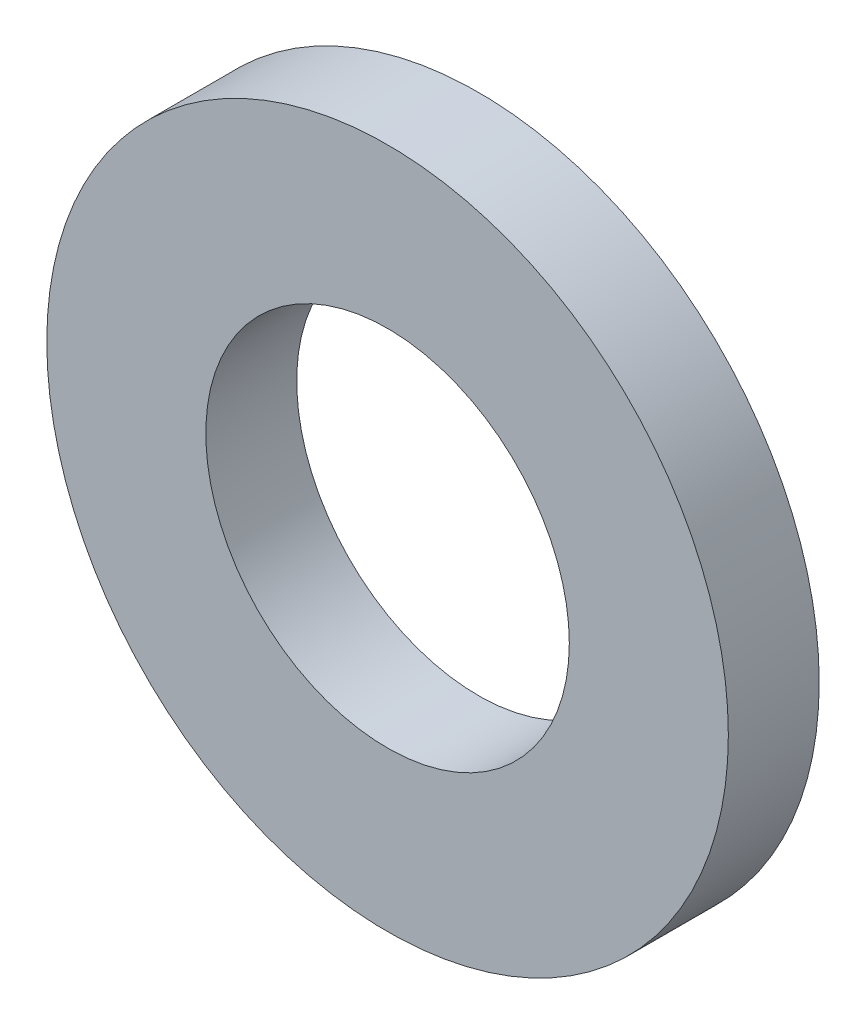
from build123d import *

# Parameters (mm, degrees)
SKIZZE1_R                       = 6
SKIZZE1_R_2                     = 3.2
AUFSATZ_LINEAR_AUSTRAGEN1_DEPTH = 1.6


with BuildPart() as part:
    # Skizze1 → Aufsatz-Linear austragen1 (new body)
    with BuildSketch(Plane.XY):
        Circle(SKIZZE1_R)
        Circle(SKIZZE1_R_2, mode=Mode.SUBTRACT)
    extrude(amount=AUFSATZ_LINEAR_AUSTRAGEN1_DEPTH)


solid = part.part
